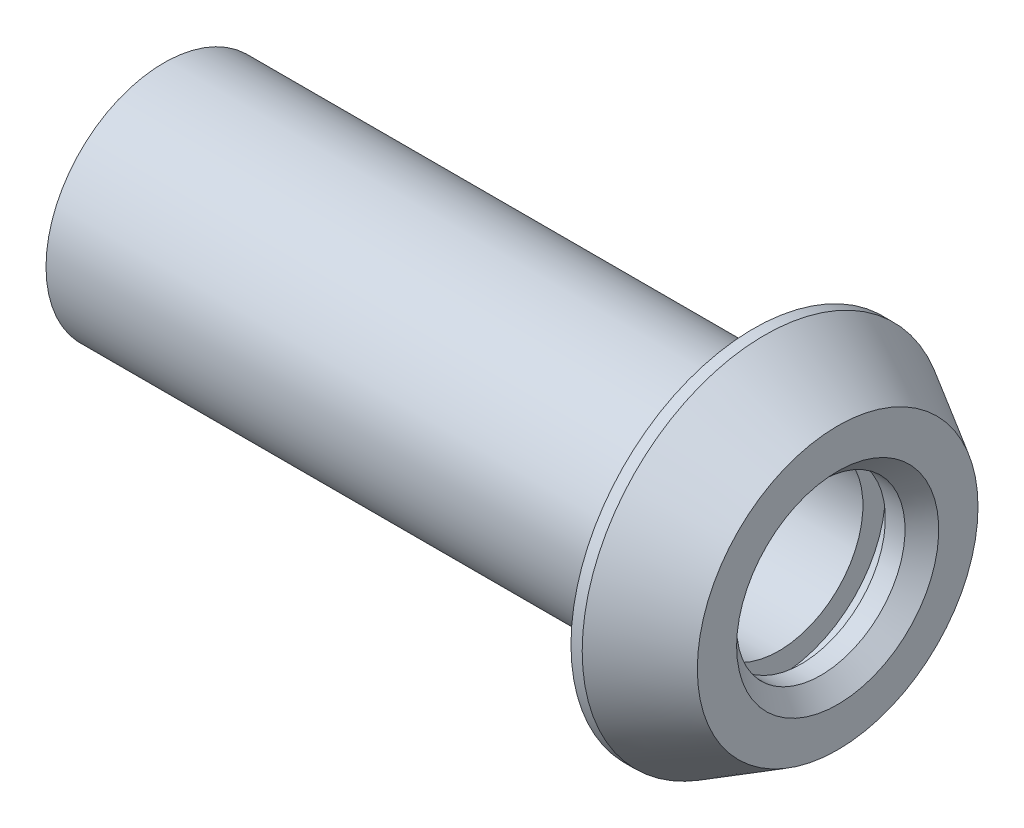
ISO-10303-21;
HEADER;
FILE_DESCRIPTION(('STEP AP214'),'2;1');
FILE_NAME('part.step','',(''),(''),'','','');
FILE_SCHEMA(('AUTOMOTIVE_DESIGN { 1 0 10303 214 1 1 1 1 }'));
ENDSEC;
DATA;
#1=APPLICATION_CONTEXT('core data for automotive mechanical design processes');
#2=APPLICATION_PROTOCOL_DEFINITION('international standard','automotive_design',2000,#1);
#3=PRODUCT_CONTEXT('',#1,'mechanical');
#4=PRODUCT('Part','Part','',(#3));
#5=PRODUCT_RELATED_PRODUCT_CATEGORY('part','',(#4));
#6=PRODUCT_DEFINITION_FORMATION('','',#4);
#7=PRODUCT_DEFINITION_CONTEXT('part definition',#1,'design');
#8=PRODUCT_DEFINITION('design','',#6,#7);
#9=PRODUCT_DEFINITION_SHAPE('','',#8);
#10=(LENGTH_UNIT() NAMED_UNIT(*) SI_UNIT(.MILLI.,.METRE.));
#11=(NAMED_UNIT(*) PLANE_ANGLE_UNIT() SI_UNIT($,.RADIAN.));
#12=(NAMED_UNIT(*) SI_UNIT($,.STERADIAN.) SOLID_ANGLE_UNIT());
#13=UNCERTAINTY_MEASURE_WITH_UNIT(LENGTH_MEASURE(1.E-05),#10,'distance_accuracy_value','');
#14=(GEOMETRIC_REPRESENTATION_CONTEXT(3) GLOBAL_UNCERTAINTY_ASSIGNED_CONTEXT((#13)) GLOBAL_UNIT_ASSIGNED_CONTEXT((#10,
#11,#12)) REPRESENTATION_CONTEXT('',''));
#15=CARTESIAN_POINT('',(0.,0.,0.));
#16=DIRECTION('',(0.,0.,1.));
#17=DIRECTION('',(1.,0.,0.));
#18=AXIS2_PLACEMENT_3D('',#15,#16,#17);
#19=CARTESIAN_POINT('',(-106.985443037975,0.,0.));
#20=DIRECTION('',(-1.,0.,0.));
#21=DIRECTION('',(0.,0.,1.));
#22=AXIS2_PLACEMENT_3D('',#19,#20,#21);
#23=CYLINDRICAL_SURFACE('',#22,21.);
#24=CARTESIAN_POINT('',(-105.,0.,0.));
#25=DIRECTION('',(-1.,0.,0.));
#26=DIRECTION('',(0.,0.,1.));
#27=AXIS2_PLACEMENT_3D('',#24,#25,#26);
#28=CIRCLE('',#27,21.);
#29=CARTESIAN_POINT('',(-105.,0.,21.));
#30=VERTEX_POINT('',#29);
#31=EDGE_CURVE('E10',#30,#30,#28,.T.);
#32=ORIENTED_EDGE('',*,*,#31,.F.);
#33=EDGE_LOOP('',(#32));
#34=FACE_BOUND('',#33,.T.);
#35=CARTESIAN_POINT('',(0.,0.,0.));
#36=DIRECTION('',(-1.,0.,0.));
#37=DIRECTION('',(0.,0.,1.));
#38=AXIS2_PLACEMENT_3D('',#35,#36,#37);
#39=CIRCLE('',#38,21.);
#40=CARTESIAN_POINT('',(0.,0.,21.));
#41=VERTEX_POINT('',#40);
#42=EDGE_CURVE('E81',#41,#41,#39,.T.);
#43=ORIENTED_EDGE('',*,*,#42,.T.);
#44=EDGE_LOOP('',(#43));
#45=FACE_BOUND('',#44,.T.);
#46=ADVANCED_FACE('F35',(#34,#45),#23,.T.);
#47=CARTESIAN_POINT('',(-105.,15.75,0.));
#48=DIRECTION('',(1.,0.,0.));
#49=DIRECTION('',(0.,0.,-1.));
#50=AXIS2_PLACEMENT_3D('',#47,#48,#49);
#51=PLANE('',#50);
#52=CARTESIAN_POINT('',(-105.,0.,0.));
#53=DIRECTION('',(-1.,0.,0.));
#54=DIRECTION('',(0.,0.,1.));
#55=AXIS2_PLACEMENT_3D('',#52,#53,#54);
#56=CIRCLE('',#55,15.75);
#57=CARTESIAN_POINT('',(-105.,0.,15.75));
#58=VERTEX_POINT('',#57);
#59=EDGE_CURVE('E41',#58,#58,#56,.T.);
#60=ORIENTED_EDGE('',*,*,#59,.F.);
#61=EDGE_LOOP('',(#60));
#62=FACE_BOUND('',#61,.T.);
#63=ORIENTED_EDGE('',*,*,#31,.T.);
#64=EDGE_LOOP('',(#63));
#65=FACE_BOUND('',#64,.T.);
#66=ADVANCED_FACE('F154',(#62,#65),#51,.F.);
#67=CARTESIAN_POINT('',(-106.985443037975,0.,0.));
#68=DIRECTION('',(-1.,0.,0.));
#69=DIRECTION('',(0.,0.,1.));
#70=AXIS2_PLACEMENT_3D('',#67,#68,#69);
#71=CYLINDRICAL_SURFACE('',#70,15.75);
#72=CARTESIAN_POINT('',(-18.,0.,0.));
#73=DIRECTION('',(-1.,0.,0.));
#74=DIRECTION('',(0.,0.,1.));
#75=AXIS2_PLACEMENT_3D('',#72,#73,#74);
#76=CIRCLE('',#75,15.75);
#77=CARTESIAN_POINT('',(-18.,0.,15.75));
#78=VERTEX_POINT('',#77);
#79=EDGE_CURVE('E45',#78,#78,#76,.T.);
#80=ORIENTED_EDGE('',*,*,#79,.F.);
#81=EDGE_LOOP('',(#80));
#82=FACE_BOUND('',#81,.T.);
#83=ORIENTED_EDGE('',*,*,#59,.T.);
#84=EDGE_LOOP('',(#83));
#85=FACE_BOUND('',#84,.T.);
#86=ADVANCED_FACE('F149',(#82,#85),#71,.F.);
#87=CARTESIAN_POINT('',(-18.,15.,0.));
#88=DIRECTION('',(1.,0.,0.));
#89=DIRECTION('',(0.,0.,-1.));
#90=AXIS2_PLACEMENT_3D('',#87,#88,#89);
#91=PLANE('',#90);
#92=CARTESIAN_POINT('',(-18.,0.,0.));
#93=DIRECTION('',(-1.,0.,0.));
#94=DIRECTION('',(0.,0.,1.));
#95=AXIS2_PLACEMENT_3D('',#92,#93,#94);
#96=CIRCLE('',#95,15.);
#97=CARTESIAN_POINT('',(-18.,0.,15.));
#98=VERTEX_POINT('',#97);
#99=EDGE_CURVE('E49',#98,#98,#96,.T.);
#100=ORIENTED_EDGE('',*,*,#99,.F.);
#101=EDGE_LOOP('',(#100));
#102=FACE_BOUND('',#101,.T.);
#103=ORIENTED_EDGE('',*,*,#79,.T.);
#104=EDGE_LOOP('',(#103));
#105=FACE_BOUND('',#104,.T.);
#106=ADVANCED_FACE('F143',(#102,#105),#91,.F.);
#107=CARTESIAN_POINT('',(-106.985443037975,0.,0.));
#108=DIRECTION('',(-1.,0.,0.));
#109=DIRECTION('',(0.,0.,1.));
#110=AXIS2_PLACEMENT_3D('',#107,#108,#109);
#111=CYLINDRICAL_SURFACE('',#110,15.);
#112=CARTESIAN_POINT('',(4.5,0.,0.));
#113=DIRECTION('',(-1.,0.,0.));
#114=DIRECTION('',(0.,0.,1.));
#115=AXIS2_PLACEMENT_3D('',#112,#113,#114);
#116=CIRCLE('',#115,15.);
#117=CARTESIAN_POINT('',(4.5,0.,15.));
#118=VERTEX_POINT('',#117);
#119=EDGE_CURVE('E54',#118,#118,#116,.T.);
#120=ORIENTED_EDGE('',*,*,#119,.F.);
#121=EDGE_LOOP('',(#120));
#122=FACE_BOUND('',#121,.T.);
#123=ORIENTED_EDGE('',*,*,#99,.T.);
#124=EDGE_LOOP('',(#123));
#125=FACE_BOUND('',#124,.T.);
#126=ADVANCED_FACE('F137',(#122,#125),#111,.F.);
#127=CARTESIAN_POINT('',(4.5,19.,0.));
#128=DIRECTION('',(-1.,0.,0.));
#129=DIRECTION('',(0.,0.,1.));
#130=AXIS2_PLACEMENT_3D('',#127,#128,#129);
#131=PLANE('',#130);
#132=CARTESIAN_POINT('',(4.5,0.,0.));
#133=DIRECTION('',(-1.,0.,0.));
#134=DIRECTION('',(0.,0.,1.));
#135=AXIS2_PLACEMENT_3D('',#132,#133,#134);
#136=CIRCLE('',#135,19.);
#137=CARTESIAN_POINT('',(4.5,0.,19.));
#138=VERTEX_POINT('',#137);
#139=EDGE_CURVE('E57',#138,#138,#136,.T.);
#140=ORIENTED_EDGE('',*,*,#139,.F.);
#141=EDGE_LOOP('',(#140));
#142=FACE_BOUND('',#141,.T.);
#143=ORIENTED_EDGE('',*,*,#119,.T.);
#144=EDGE_LOOP('',(#143));
#145=FACE_BOUND('',#144,.T.);
#146=ADVANCED_FACE('F131',(#142,#145),#131,.F.);
#147=CARTESIAN_POINT('',(-106.985443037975,0.,0.));
#148=DIRECTION('',(-1.,0.,0.));
#149=DIRECTION('',(0.,0.,1.));
#150=AXIS2_PLACEMENT_3D('',#147,#148,#149);
#151=CYLINDRICAL_SURFACE('',#150,19.);
#152=CARTESIAN_POINT('',(8.49999999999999,0.,0.));
#153=DIRECTION('',(-1.,0.,0.));
#154=DIRECTION('',(0.,0.,1.));
#155=AXIS2_PLACEMENT_3D('',#152,#153,#154);
#156=CIRCLE('',#155,19.);
#157=CARTESIAN_POINT('',(8.49999999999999,0.,19.));
#158=VERTEX_POINT('',#157);
#159=EDGE_CURVE('E60',#158,#158,#156,.T.);
#160=ORIENTED_EDGE('',*,*,#159,.F.);
#161=EDGE_LOOP('',(#160));
#162=FACE_BOUND('',#161,.T.);
#163=ORIENTED_EDGE('',*,*,#139,.T.);
#164=EDGE_LOOP('',(#163));
#165=FACE_BOUND('',#164,.T.);
#166=ADVANCED_FACE('F125',(#162,#165),#151,.F.);
#167=CARTESIAN_POINT('',(8.5,15.,0.));
#168=DIRECTION('',(1.,0.,0.));
#169=DIRECTION('',(0.,0.,-1.));
#170=AXIS2_PLACEMENT_3D('',#167,#168,#169);
#171=PLANE('',#170);
#172=CARTESIAN_POINT('',(8.49999999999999,0.,0.));
#173=DIRECTION('',(-1.,0.,0.));
#174=DIRECTION('',(0.,0.,1.));
#175=AXIS2_PLACEMENT_3D('',#172,#173,#174);
#176=CIRCLE('',#175,15.);
#177=CARTESIAN_POINT('',(8.49999999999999,0.,15.));
#178=VERTEX_POINT('',#177);
#179=EDGE_CURVE('E63',#178,#178,#176,.T.);
#180=ORIENTED_EDGE('',*,*,#179,.F.);
#181=EDGE_LOOP('',(#180));
#182=FACE_BOUND('',#181,.T.);
#183=ORIENTED_EDGE('',*,*,#159,.T.);
#184=EDGE_LOOP('',(#183));
#185=FACE_BOUND('',#184,.T.);
#186=ADVANCED_FACE('F119',(#182,#185),#171,.F.);
#187=CARTESIAN_POINT('',(-106.985443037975,0.,0.));
#188=DIRECTION('',(-1.,0.,0.));
#189=DIRECTION('',(0.,0.,1.));
#190=AXIS2_PLACEMENT_3D('',#187,#188,#189);
#191=CYLINDRICAL_SURFACE('',#190,15.);
#192=CARTESIAN_POINT('',(12.,0.,0.));
#193=DIRECTION('',(-1.,0.,0.));
#194=DIRECTION('',(0.,0.,1.));
#195=AXIS2_PLACEMENT_3D('',#192,#193,#194);
#196=CIRCLE('',#195,15.);
#197=CARTESIAN_POINT('',(12.,0.,15.));
#198=VERTEX_POINT('',#197);
#199=EDGE_CURVE('E66',#198,#198,#196,.T.);
#200=ORIENTED_EDGE('',*,*,#199,.F.);
#201=EDGE_LOOP('',(#200));
#202=FACE_BOUND('',#201,.T.);
#203=ORIENTED_EDGE('',*,*,#179,.T.);
#204=EDGE_LOOP('',(#203));
#205=FACE_BOUND('',#204,.T.);
#206=ADVANCED_FACE('F113',(#202,#205),#191,.F.);
#207=CARTESIAN_POINT('',(12.,0.,0.));
#208=DIRECTION('',(1.,0.,0.));
#209=DIRECTION('',(0.,0.,-1.));
#210=AXIS2_PLACEMENT_3D('',#207,#208,#209);
#211=CONICAL_SURFACE('',#210,15.,0.785398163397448);
#212=CARTESIAN_POINT('',(15.,0.,0.));
#213=DIRECTION('',(-1.,0.,0.));
#214=DIRECTION('',(0.,0.,1.));
#215=AXIS2_PLACEMENT_3D('',#212,#213,#214);
#216=CIRCLE('',#215,18.);
#217=CARTESIAN_POINT('',(15.,0.,18.));
#218=VERTEX_POINT('',#217);
#219=EDGE_CURVE('E69',#218,#218,#216,.T.);
#220=ORIENTED_EDGE('',*,*,#219,.F.);
#221=EDGE_LOOP('',(#220));
#222=FACE_BOUND('',#221,.T.);
#223=ORIENTED_EDGE('',*,*,#199,.T.);
#224=EDGE_LOOP('',(#223));
#225=FACE_BOUND('',#224,.T.);
#226=ADVANCED_FACE('F107',(#222,#225),#211,.F.);
#227=CARTESIAN_POINT('',(15.,24.9944465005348,0.));
#228=DIRECTION('',(-1.,0.,0.));
#229=DIRECTION('',(0.,0.,1.));
#230=AXIS2_PLACEMENT_3D('',#227,#228,#229);
#231=PLANE('',#230);
#232=CARTESIAN_POINT('',(15.,0.,0.));
#233=DIRECTION('',(-1.,0.,0.));
#234=DIRECTION('',(0.,0.,1.));
#235=AXIS2_PLACEMENT_3D('',#232,#233,#234);
#236=CIRCLE('',#235,24.9944465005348);
#237=CARTESIAN_POINT('',(15.,0.,24.9944465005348));
#238=VERTEX_POINT('',#237);
#239=EDGE_CURVE('E72',#238,#238,#236,.T.);
#240=ORIENTED_EDGE('',*,*,#239,.F.);
#241=EDGE_LOOP('',(#240));
#242=FACE_BOUND('',#241,.T.);
#243=ORIENTED_EDGE('',*,*,#219,.T.);
#244=EDGE_LOOP('',(#243));
#245=FACE_BOUND('',#244,.T.);
#246=ADVANCED_FACE('F101',(#242,#245),#231,.F.);
#247=CARTESIAN_POINT('',(15.,0.,0.));
#248=DIRECTION('',(-1.,0.,0.));
#249=DIRECTION('',(0.,0.,1.));
#250=AXIS2_PLACEMENT_3D('',#247,#248,#249);
#251=CONICAL_SURFACE('',#250,24.9944465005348,0.5235987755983);
#252=CARTESIAN_POINT('',(2.,0.,0.));
#253=DIRECTION('',(-1.,0.,0.));
#254=DIRECTION('',(0.,0.,1.));
#255=AXIS2_PLACEMENT_3D('',#252,#253,#254);
#256=CIRCLE('',#255,32.5);
#257=CARTESIAN_POINT('',(2.,0.,32.5));
#258=VERTEX_POINT('',#257);
#259=EDGE_CURVE('E75',#258,#258,#256,.T.);
#260=ORIENTED_EDGE('',*,*,#259,.F.);
#261=EDGE_LOOP('',(#260));
#262=FACE_BOUND('',#261,.T.);
#263=ORIENTED_EDGE('',*,*,#239,.T.);
#264=EDGE_LOOP('',(#263));
#265=FACE_BOUND('',#264,.T.);
#266=ADVANCED_FACE('F95',(#262,#265),#251,.T.);
#267=CARTESIAN_POINT('',(-106.985443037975,0.,0.));
#268=DIRECTION('',(-1.,0.,0.));
#269=DIRECTION('',(0.,0.,1.));
#270=AXIS2_PLACEMENT_3D('',#267,#268,#269);
#271=CYLINDRICAL_SURFACE('',#270,32.5);
#272=CARTESIAN_POINT('',(0.,0.,0.));
#273=DIRECTION('',(-1.,0.,0.));
#274=DIRECTION('',(0.,0.,1.));
#275=AXIS2_PLACEMENT_3D('',#272,#273,#274);
#276=CIRCLE('',#275,32.5);
#277=CARTESIAN_POINT('',(0.,0.,32.5));
#278=VERTEX_POINT('',#277);
#279=EDGE_CURVE('E78',#278,#278,#276,.T.);
#280=ORIENTED_EDGE('',*,*,#279,.F.);
#281=EDGE_LOOP('',(#280));
#282=FACE_BOUND('',#281,.T.);
#283=ORIENTED_EDGE('',*,*,#259,.T.);
#284=EDGE_LOOP('',(#283));
#285=FACE_BOUND('',#284,.T.);
#286=ADVANCED_FACE('F89',(#282,#285),#271,.T.);
#287=CARTESIAN_POINT('',(0.,21.,0.));
#288=DIRECTION('',(1.,0.,0.));
#289=DIRECTION('',(0.,0.,-1.));
#290=AXIS2_PLACEMENT_3D('',#287,#288,#289);
#291=PLANE('',#290);
#292=ORIENTED_EDGE('',*,*,#42,.F.);
#293=EDGE_LOOP('',(#292));
#294=FACE_BOUND('',#293,.T.);
#295=ORIENTED_EDGE('',*,*,#279,.T.);
#296=EDGE_LOOP('',(#295));
#297=FACE_BOUND('',#296,.T.);
#298=ADVANCED_FACE('F86',(#294,#297),#291,.F.);
#299=CLOSED_SHELL('',(#46,#66,#86,#106,#126,#146,#166,#186,#206,#226,#246,#266,#286,#298));
#300=MANIFOLD_SOLID_BREP('B2',#299);
#301=ADVANCED_BREP_SHAPE_REPRESENTATION('',(#18,#300),#14);
#302=SHAPE_DEFINITION_REPRESENTATION(#9,#301);
ENDSEC;
END-ISO-10303-21;
